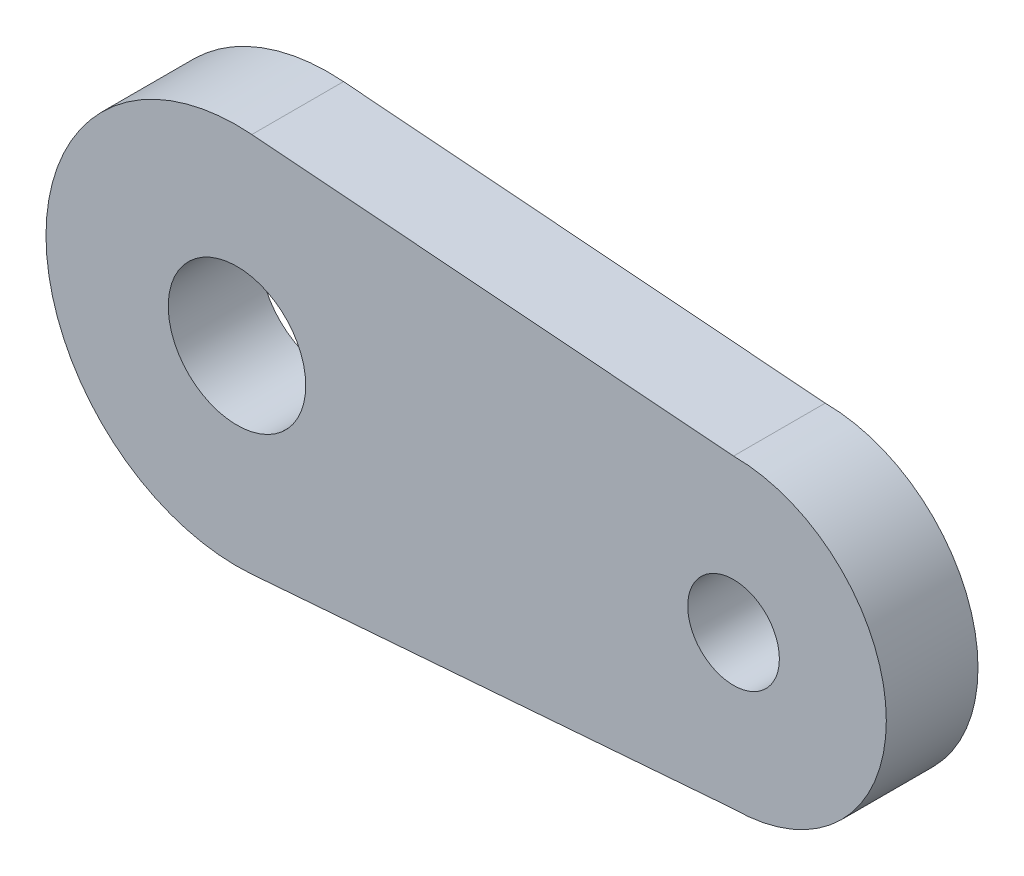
from build123d import *

# Parameters (mm, degrees)
SKETCH_1_R      = 9
SKETCH_1_R_2    = 6
EXTRUDE_1_DEPTH = 12


with BuildPart() as part:
    # Sketch 1 → Extrude 1 (new body)
    with BuildSketch(Plane.XY):
        with BuildLine():
            Line((1.946426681, -24.924113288), (65, -20))
            ThreePointArc((65, -20), (85, 0), (65, 20))
            Line((65, 20), (1.946426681, 24.924113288))
            ThreePointArc((1.946426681, 24.924113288), (-25, 0), (1.946426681, -24.924113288))
        make_face()
        Circle(SKETCH_1_R, mode=Mode.SUBTRACT)
        with Locations((65, 0)):
            Circle(SKETCH_1_R_2, mode=Mode.SUBTRACT)
    extrude(amount=EXTRUDE_1_DEPTH)


solid = part.part
